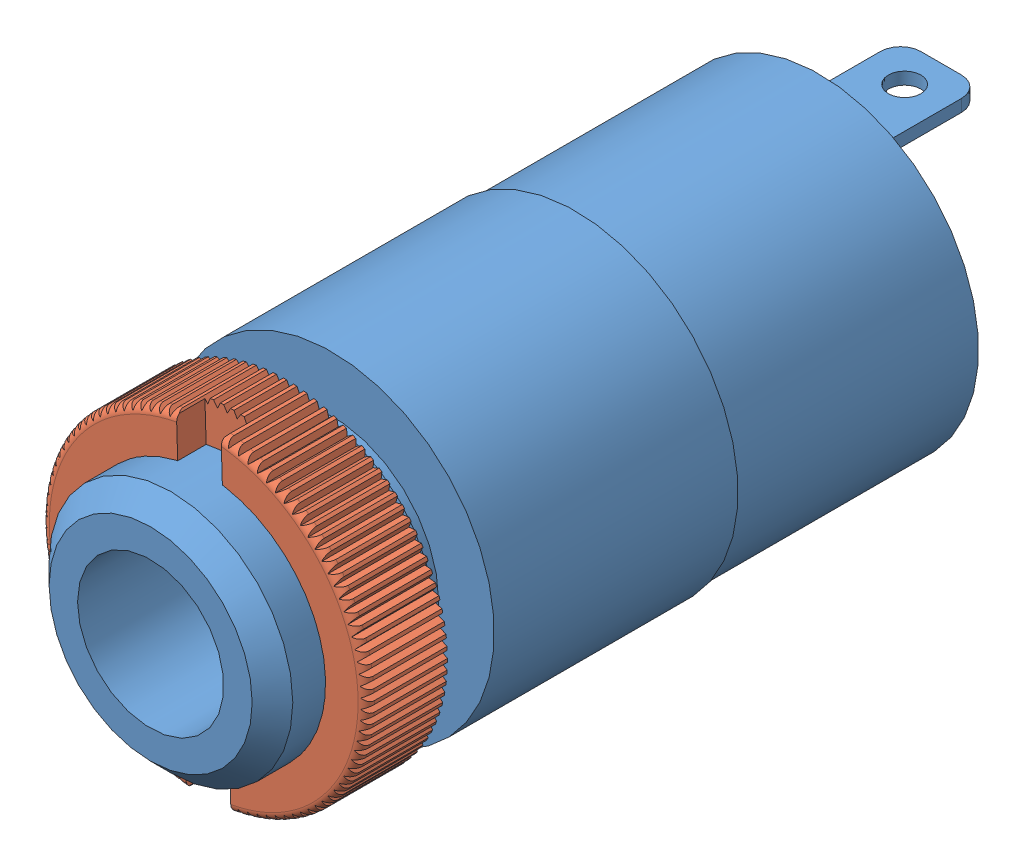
SolidWorks assembly User Library-3.5MM Panel Mount Audio Jack - 3 Connector.sldasm, configuration Default (file format 12000). Lengths in mm.
Overall size (8.27 8.24 20.46).
2 component instances, 2 part files, 0 mates.
Components (placement in the parent):
- User Library-3.5MM Panel Mount Audio Jack - 3 Connector_3.5MM Panel Mount Audio Jack - 4 Connector - korpus-1: User Library-3.5MM Panel Mount Audio Jack - 3 Connector_3.5MM Panel Mount Audio Jack - 4 Connector - korpus.sldprt [Default] at (-2.7774 4.5478 6.23) size (8 8 20.46)
- User Library-3.5MM Panel Mount Audio Jack - 3 Connector_3.5MM Panel Mount Audio Jack - 4 Connector - nakr_X2_0119_X0_tka-1: User Library-3.5MM Panel Mount Audio Jack - 3 Connector_3.5MM Panel Mount Audio Jack - 4 Connector - nakr_X2_0119_X0_tka.sldprt [Default] at (-2.7774 4.5478 6.9241) x (0.999528 0.030714 0) z (0 0 1) size (8.03 8 2.01)
